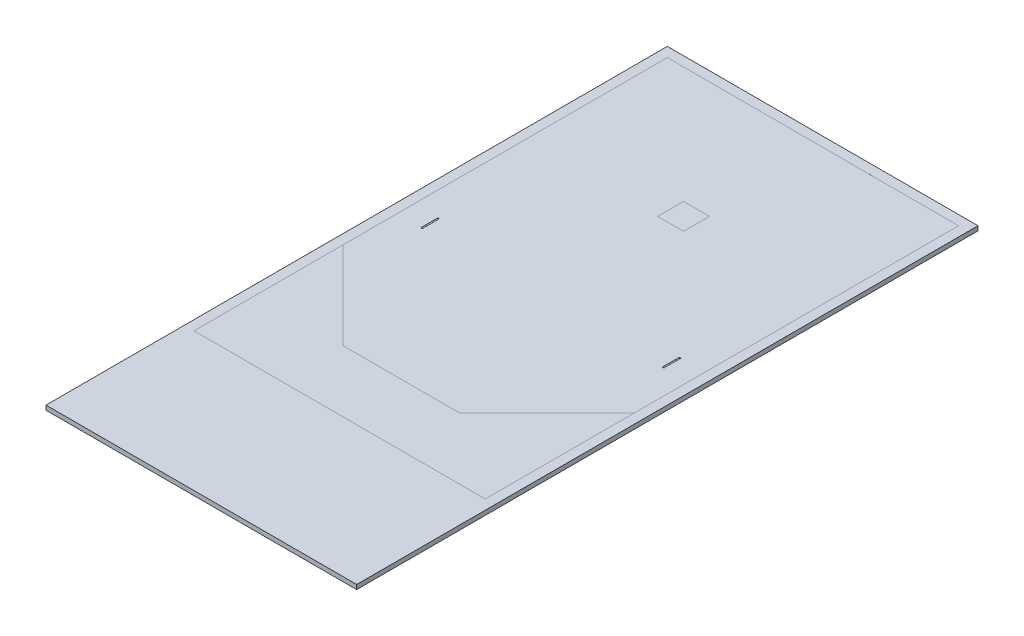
ISO-10303-21;
HEADER;
FILE_DESCRIPTION(('STEP AP214'),'2;1');
FILE_NAME('part.step','',(''),(''),'','','');
FILE_SCHEMA(('AUTOMOTIVE_DESIGN { 1 0 10303 214 1 1 1 1 }'));
ENDSEC;
DATA;
#1=APPLICATION_CONTEXT('core data for automotive mechanical design processes');
#2=APPLICATION_PROTOCOL_DEFINITION('international standard','automotive_design',2000,#1);
#3=PRODUCT_CONTEXT('',#1,'mechanical');
#4=PRODUCT('Part','Part','',(#3));
#5=PRODUCT_RELATED_PRODUCT_CATEGORY('part','',(#4));
#6=PRODUCT_DEFINITION_FORMATION('','',#4);
#7=PRODUCT_DEFINITION_CONTEXT('part definition',#1,'design');
#8=PRODUCT_DEFINITION('design','',#6,#7);
#9=PRODUCT_DEFINITION_SHAPE('','',#8);
#10=(LENGTH_UNIT() NAMED_UNIT(*) SI_UNIT(.MILLI.,.METRE.));
#11=(NAMED_UNIT(*) PLANE_ANGLE_UNIT() SI_UNIT($,.RADIAN.));
#12=(NAMED_UNIT(*) SI_UNIT($,.STERADIAN.) SOLID_ANGLE_UNIT());
#13=UNCERTAINTY_MEASURE_WITH_UNIT(LENGTH_MEASURE(1.E-05),#10,'distance_accuracy_value','');
#14=(GEOMETRIC_REPRESENTATION_CONTEXT(3) GLOBAL_UNCERTAINTY_ASSIGNED_CONTEXT((#13)) GLOBAL_UNIT_ASSIGNED_CONTEXT((#10,
#11,#12)) REPRESENTATION_CONTEXT('',''));
#15=CARTESIAN_POINT('',(0.,0.,0.));
#16=DIRECTION('',(0.,0.,1.));
#17=DIRECTION('',(1.,0.,0.));
#18=AXIS2_PLACEMENT_3D('',#15,#16,#17);
#19=CARTESIAN_POINT('',(0.,8.730742,0.));
#20=DIRECTION('',(0.,1.,0.));
#21=DIRECTION('',(0.,0.,1.));
#22=AXIS2_PLACEMENT_3D('',#19,#20,#21);
#23=PLANE('',#22);
#24=DIRECTION('',(-1.,0.,0.));
#25=VECTOR('',#24,1.);
#26=CARTESIAN_POINT('',(0.,8.730742,-1404.9375));
#27=LINE('',#26,#25);
#28=CARTESIAN_POINT('',(-470.68740004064,8.730742,-1404.9375));
#29=VERTEX_POINT('',#28);
#30=CARTESIAN_POINT('',(-477.03739995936,8.730742,-1404.9375));
#31=VERTEX_POINT('',#30);
#32=EDGE_CURVE('E11',#29,#31,#27,.T.);
#33=ORIENTED_EDGE('',*,*,#32,.F.);
#34=DIRECTION('',(0.,0.,1.));
#35=VECTOR('',#34,1.);
#36=CARTESIAN_POINT('',(-470.68740004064,8.730742,-1404.9375));
#37=LINE('',#36,#35);
#38=CARTESIAN_POINT('',(-470.68740004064,8.730742,-1338.2625));
#39=VERTEX_POINT('',#38);
#40=EDGE_CURVE('E174',#39,#29,#37,.F.);
#41=ORIENTED_EDGE('',*,*,#40,.F.);
#42=DIRECTION('',(-1.,0.,0.));
#43=VECTOR('',#42,1.);
#44=CARTESIAN_POINT('',(0.,8.730742,-1338.2625));
#45=LINE('',#44,#43);
#46=CARTESIAN_POINT('',(-477.0374,8.730742,-1338.2625));
#47=VERTEX_POINT('',#46);
#48=EDGE_CURVE('E169',#39,#47,#45,.T.);
#49=ORIENTED_EDGE('',*,*,#48,.T.);
#50=DIRECTION('',(0.,0.,1.));
#51=VECTOR('',#50,1.);
#52=CARTESIAN_POINT('',(-477.03739995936,8.730742,-1404.9375));
#53=LINE('',#52,#51);
#54=EDGE_CURVE('E43',#31,#47,#53,.T.);
#55=ORIENTED_EDGE('',*,*,#54,.F.);
#56=EDGE_LOOP('',(#33,#41,#49,#55));
#57=FACE_BOUND('',#56,.T.);
#58=DIRECTION('',(-1.,0.,0.));
#59=VECTOR('',#58,1.);
#60=CARTESIAN_POINT('',(0.,8.730742,-1404.9375));
#61=LINE('',#60,#59);
#62=CARTESIAN_POINT('',(477.03739995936,8.730742,-1404.9375));
#63=VERTEX_POINT('',#62);
#64=CARTESIAN_POINT('',(470.68740004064,8.730742,-1404.9375));
#65=VERTEX_POINT('',#64);
#66=EDGE_CURVE('E175',#63,#65,#61,.T.);
#67=ORIENTED_EDGE('',*,*,#66,.F.);
#68=DIRECTION('',(0.,0.,1.));
#69=VECTOR('',#68,1.);
#70=CARTESIAN_POINT('',(477.03739995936,8.730742,-1404.9375));
#71=LINE('',#70,#69);
#72=CARTESIAN_POINT('',(477.03739995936,8.730742,-1338.2625));
#73=VERTEX_POINT('',#72);
#74=EDGE_CURVE('E191',#63,#73,#71,.T.);
#75=ORIENTED_EDGE('',*,*,#74,.T.);
#76=DIRECTION('',(-1.,0.,0.));
#77=VECTOR('',#76,1.);
#78=CARTESIAN_POINT('',(0.,8.730742,-1338.2625));
#79=LINE('',#78,#77);
#80=CARTESIAN_POINT('',(470.6874,8.730742,-1338.2625));
#81=VERTEX_POINT('',#80);
#82=EDGE_CURVE('E194',#73,#81,#79,.T.);
#83=ORIENTED_EDGE('',*,*,#82,.T.);
#84=DIRECTION('',(0.,0.,1.));
#85=VECTOR('',#84,1.);
#86=CARTESIAN_POINT('',(470.68740004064,8.730742,-1404.9375));
#87=LINE('',#86,#85);
#88=EDGE_CURVE('E188',#81,#65,#87,.F.);
#89=ORIENTED_EDGE('',*,*,#88,.T.);
#90=EDGE_LOOP('',(#67,#75,#83,#89));
#91=FACE_BOUND('',#90,.T.);
#92=DIRECTION('',(0.,0.,1.));
#93=VECTOR('',#92,1.);
#94=CARTESIAN_POINT('',(571.5,8.730742,0.));
#95=LINE('',#94,#93);
#96=CARTESIAN_POINT('',(571.5,8.730742,-2400.3));
#97=VERTEX_POINT('',#96);
#98=CARTESIAN_POINT('',(571.5,8.730742,-1127.7854));
#99=VERTEX_POINT('',#98);
#100=EDGE_CURVE('E277',#97,#99,#95,.T.);
#101=ORIENTED_EDGE('',*,*,#100,.F.);
#102=DIRECTION('',(1.,0.,0.));
#103=VECTOR('',#102,1.);
#104=CARTESIAN_POINT('',(0.,8.730742,-2400.3));
#105=LINE('',#104,#103);
#106=CARTESIAN_POINT('',(-571.5,8.730742,-2400.3));
#107=VERTEX_POINT('',#106);
#108=EDGE_CURVE('E289',#107,#97,#105,.T.);
#109=ORIENTED_EDGE('',*,*,#108,.F.);
#110=DIRECTION('',(0.,0.,-1.));
#111=VECTOR('',#110,1.);
#112=CARTESIAN_POINT('',(-571.5,8.730742,0.));
#113=LINE('',#112,#111);
#114=CARTESIAN_POINT('',(-571.5,8.730742,-1127.7854));
#115=VERTEX_POINT('',#114);
#116=EDGE_CURVE('E287',#115,#107,#113,.T.);
#117=ORIENTED_EDGE('',*,*,#116,.F.);
#118=DIRECTION('',(0.707106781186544,0.,0.707106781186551));
#119=VECTOR('',#118,1.);
#120=CARTESIAN_POINT('',(278.142699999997,8.730742,-278.142699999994));
#121=LINE('',#120,#119);
#122=CARTESIAN_POINT('',(-228.6,8.730742,-784.885399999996));
#123=VERTEX_POINT('',#122);
#124=EDGE_CURVE('E284',#115,#123,#121,.T.);
#125=ORIENTED_EDGE('',*,*,#124,.T.);
#126=DIRECTION('',(1.,0.,0.));
#127=VECTOR('',#126,1.);
#128=CARTESIAN_POINT('',(3.81188907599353E-13,8.730742,-784.885399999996));
#129=LINE('',#128,#127);
#130=CARTESIAN_POINT('',(228.6,8.730742,-784.885399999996));
#131=VERTEX_POINT('',#130);
#132=EDGE_CURVE('E281',#123,#131,#129,.T.);
#133=ORIENTED_EDGE('',*,*,#132,.T.);
#134=DIRECTION('',(0.707106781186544,0.,-0.707106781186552));
#135=VECTOR('',#134,1.);
#136=CARTESIAN_POINT('',(-278.142699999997,8.730742,-278.142699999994));
#137=LINE('',#136,#135);
#138=EDGE_CURVE('E261',#131,#99,#137,.T.);
#139=ORIENTED_EDGE('',*,*,#138,.T.);
#140=EDGE_LOOP('',(#101,#109,#117,#125,#133,#139));
#141=FACE_BOUND('',#140,.T.);
#142=DIRECTION('',(0.,0.,1.));
#143=VECTOR('',#142,1.);
#144=CARTESIAN_POINT('',(-50.8000000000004,8.730742,-1841.5));
#145=LINE('',#144,#143);
#146=CARTESIAN_POINT('',(-50.8000000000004,8.730742,-1943.1));
#147=VERTEX_POINT('',#146);
#148=CARTESIAN_POINT('',(-50.8000000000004,8.730742,-1841.5));
#149=VERTEX_POINT('',#148);
#150=EDGE_CURVE('E313',#147,#149,#145,.T.);
#151=ORIENTED_EDGE('',*,*,#150,.F.);
#152=DIRECTION('',(-1.,0.,0.));
#153=VECTOR('',#152,1.);
#154=CARTESIAN_POINT('',(50.7999999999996,8.730742,-1943.1));
#155=LINE('',#154,#153);
#156=CARTESIAN_POINT('',(50.7999999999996,8.730742,-1943.1));
#157=VERTEX_POINT('',#156);
#158=EDGE_CURVE('E305',#157,#147,#155,.T.);
#159=ORIENTED_EDGE('',*,*,#158,.F.);
#160=DIRECTION('',(0.,0.,-1.));
#161=VECTOR('',#160,1.);
#162=CARTESIAN_POINT('',(50.7999999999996,8.730742,-1841.5));
#163=LINE('',#162,#161);
#164=CARTESIAN_POINT('',(50.7999999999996,8.730742,-1841.5));
#165=VERTEX_POINT('',#164);
#166=EDGE_CURVE('E307',#165,#157,#163,.T.);
#167=ORIENTED_EDGE('',*,*,#166,.F.);
#168=DIRECTION('',(1.,0.,0.));
#169=VECTOR('',#168,1.);
#170=CARTESIAN_POINT('',(50.7999999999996,8.730742,-1841.5));
#171=LINE('',#170,#169);
#172=EDGE_CURVE('E310',#149,#165,#171,.T.);
#173=ORIENTED_EDGE('',*,*,#172,.F.);
#174=EDGE_LOOP('',(#151,#159,#167,#173));
#175=FACE_BOUND('',#174,.T.);
#176=ADVANCED_FACE('F35',(#57,#91,#141,#175),#23,.T.);
#177=CARTESIAN_POINT('',(-609.6,8.73125,-2438.4));
#178=DIRECTION('',(0.,-1.,0.));
#179=DIRECTION('',(0.,0.,-1.));
#180=AXIS2_PLACEMENT_3D('',#177,#178,#179);
#181=PLANE('',#180);
#182=DIRECTION('',(1.,0.,0.));
#183=VECTOR('',#182,1.);
#184=CARTESIAN_POINT('',(-609.6,8.73125,0.));
#185=LINE('',#184,#183);
#186=CARTESIAN_POINT('',(-609.6,8.73125,0.));
#187=VERTEX_POINT('',#186);
#188=CARTESIAN_POINT('',(609.6,8.73125,0.));
#189=VERTEX_POINT('',#188);
#190=EDGE_CURVE('E214',#187,#189,#185,.T.);
#191=ORIENTED_EDGE('',*,*,#190,.T.);
#192=DIRECTION('',(0.,0.,1.));
#193=VECTOR('',#192,1.);
#194=CARTESIAN_POINT('',(609.6,8.73125,-2438.4));
#195=LINE('',#194,#193);
#196=CARTESIAN_POINT('',(609.6,8.73125,-2438.4));
#197=VERTEX_POINT('',#196);
#198=EDGE_CURVE('E200',#197,#189,#195,.T.);
#199=ORIENTED_EDGE('',*,*,#198,.F.);
#200=DIRECTION('',(1.,0.,0.));
#201=VECTOR('',#200,1.);
#202=CARTESIAN_POINT('',(-609.6,8.73125,-2438.4));
#203=LINE('',#202,#201);
#204=CARTESIAN_POINT('',(-609.6,8.73125,-2438.4));
#205=VERTEX_POINT('',#204);
#206=EDGE_CURVE('E226',#205,#197,#203,.T.);
#207=ORIENTED_EDGE('',*,*,#206,.F.);
#208=DIRECTION('',(0.,0.,1.));
#209=VECTOR('',#208,1.);
#210=CARTESIAN_POINT('',(-609.6,8.73125,-2438.4));
#211=LINE('',#210,#209);
#212=EDGE_CURVE('E197',#205,#187,#211,.T.);
#213=ORIENTED_EDGE('',*,*,#212,.T.);
#214=EDGE_LOOP('',(#191,#199,#207,#213));
#215=FACE_BOUND('',#214,.T.);
#216=DIRECTION('',(1.,0.,0.));
#217=VECTOR('',#216,1.);
#218=CARTESIAN_POINT('',(0.,8.73125,-2400.3));
#219=LINE('',#218,#217);
#220=CARTESIAN_POINT('',(-571.5,8.73125,-2400.3));
#221=VERTEX_POINT('',#220);
#222=CARTESIAN_POINT('',(571.5,8.73125,-2400.3));
#223=VERTEX_POINT('',#222);
#224=EDGE_CURVE('E274',#221,#223,#219,.T.);
#225=ORIENTED_EDGE('',*,*,#224,.T.);
#226=DIRECTION('',(0.,0.,1.));
#227=VECTOR('',#226,1.);
#228=CARTESIAN_POINT('',(571.5,8.73125,0.));
#229=LINE('',#228,#227);
#230=CARTESIAN_POINT('',(571.5,8.73125,-542.925));
#231=VERTEX_POINT('',#230);
#232=EDGE_CURVE('E235',#223,#231,#229,.T.);
#233=ORIENTED_EDGE('',*,*,#232,.T.);
#234=DIRECTION('',(1.,0.,0.));
#235=VECTOR('',#234,1.);
#236=CARTESIAN_POINT('',(0.,8.73125,-542.925));
#237=LINE('',#236,#235);
#238=CARTESIAN_POINT('',(-571.5,8.73125,-542.925));
#239=VERTEX_POINT('',#238);
#240=EDGE_CURVE('E239',#239,#231,#237,.T.);
#241=ORIENTED_EDGE('',*,*,#240,.F.);
#242=DIRECTION('',(0.,0.,-1.));
#243=VECTOR('',#242,1.);
#244=CARTESIAN_POINT('',(-571.5,8.73125,0.));
#245=LINE('',#244,#243);
#246=EDGE_CURVE('E242',#239,#221,#245,.T.);
#247=ORIENTED_EDGE('',*,*,#246,.T.);
#248=EDGE_LOOP('',(#225,#233,#241,#247));
#249=FACE_BOUND('',#248,.T.);
#250=ADVANCED_FACE('F339',(#215,#249),#181,.F.);
#251=CARTESIAN_POINT('',(-609.6,-8.73125,-2438.4));
#252=DIRECTION('',(1.,0.,0.));
#253=DIRECTION('',(0.,0.,-1.));
#254=AXIS2_PLACEMENT_3D('',#251,#252,#253);
#255=PLANE('',#254);
#256=DIRECTION('',(0.,1.,0.));
#257=VECTOR('',#256,1.);
#258=CARTESIAN_POINT('',(-609.6,-8.73125,0.));
#259=LINE('',#258,#257);
#260=CARTESIAN_POINT('',(-609.6,-8.73125,0.));
#261=VERTEX_POINT('',#260);
#262=EDGE_CURVE('E217',#261,#187,#259,.T.);
#263=ORIENTED_EDGE('',*,*,#262,.T.);
#264=ORIENTED_EDGE('',*,*,#212,.F.);
#265=DIRECTION('',(0.,1.,0.));
#266=VECTOR('',#265,1.);
#267=CARTESIAN_POINT('',(-609.6,-8.73125,-2438.4));
#268=LINE('',#267,#266);
#269=CARTESIAN_POINT('',(-609.6,-8.73125,-2438.4));
#270=VERTEX_POINT('',#269);
#271=EDGE_CURVE('E210',#270,#205,#268,.T.);
#272=ORIENTED_EDGE('',*,*,#271,.F.);
#273=DIRECTION('',(0.,0.,1.));
#274=VECTOR('',#273,1.);
#275=CARTESIAN_POINT('',(-609.6,-8.73125,-2438.4));
#276=LINE('',#275,#274);
#277=EDGE_CURVE('E204',#270,#261,#276,.T.);
#278=ORIENTED_EDGE('',*,*,#277,.T.);
#279=EDGE_LOOP('',(#263,#264,#272,#278));
#280=FACE_BOUND('',#279,.T.);
#281=ADVANCED_FACE('F37',(#280),#255,.F.);
#282=CARTESIAN_POINT('',(609.6,-8.73125,-2438.4));
#283=DIRECTION('',(1.,0.,0.));
#284=DIRECTION('',(0.,0.,-1.));
#285=AXIS2_PLACEMENT_3D('',#282,#283,#284);
#286=PLANE('',#285);
#287=DIRECTION('',(0.,1.,0.));
#288=VECTOR('',#287,1.);
#289=CARTESIAN_POINT('',(609.6,-8.73125,0.));
#290=LINE('',#289,#288);
#291=CARTESIAN_POINT('',(609.6,-8.73125,0.));
#292=VERTEX_POINT('',#291);
#293=EDGE_CURVE('E211',#292,#189,#290,.T.);
#294=ORIENTED_EDGE('',*,*,#293,.F.);
#295=DIRECTION('',(0.,0.,1.));
#296=VECTOR('',#295,1.);
#297=CARTESIAN_POINT('',(609.6,-8.73125,-2438.4));
#298=LINE('',#297,#296);
#299=CARTESIAN_POINT('',(609.6,-8.73125,-2438.4));
#300=VERTEX_POINT('',#299);
#301=EDGE_CURVE('E202',#300,#292,#298,.T.);
#302=ORIENTED_EDGE('',*,*,#301,.F.);
#303=DIRECTION('',(0.,1.,0.));
#304=VECTOR('',#303,1.);
#305=CARTESIAN_POINT('',(609.6,-8.73125,-2438.4));
#306=LINE('',#305,#304);
#307=EDGE_CURVE('E223',#300,#197,#306,.T.);
#308=ORIENTED_EDGE('',*,*,#307,.T.);
#309=ORIENTED_EDGE('',*,*,#198,.T.);
#310=EDGE_LOOP('',(#294,#302,#308,#309));
#311=FACE_BOUND('',#310,.T.);
#312=ADVANCED_FACE('F394',(#311),#286,.T.);
#313=CARTESIAN_POINT('',(-609.6,-8.73125,-2438.4));
#314=DIRECTION('',(0.,-1.,0.));
#315=DIRECTION('',(0.,0.,-1.));
#316=AXIS2_PLACEMENT_3D('',#313,#314,#315);
#317=PLANE('',#316);
#318=DIRECTION('',(1.,0.,0.));
#319=VECTOR('',#318,1.);
#320=CARTESIAN_POINT('',(-609.6,-8.73125,0.));
#321=LINE('',#320,#319);
#322=EDGE_CURVE('E207',#261,#292,#321,.T.);
#323=ORIENTED_EDGE('',*,*,#322,.F.);
#324=ORIENTED_EDGE('',*,*,#277,.F.);
#325=DIRECTION('',(1.,0.,0.));
#326=VECTOR('',#325,1.);
#327=CARTESIAN_POINT('',(-609.6,-8.73125,-2438.4));
#328=LINE('',#327,#326);
#329=EDGE_CURVE('E206',#270,#300,#328,.T.);
#330=ORIENTED_EDGE('',*,*,#329,.T.);
#331=ORIENTED_EDGE('',*,*,#301,.T.);
#332=EDGE_LOOP('',(#323,#324,#330,#331));
#333=FACE_BOUND('',#332,.T.);
#334=ADVANCED_FACE('F387',(#333),#317,.T.);
#335=CARTESIAN_POINT('',(0.,0.,-2438.4));
#336=DIRECTION('',(0.,0.,-1.));
#337=DIRECTION('',(-1.,0.,0.));
#338=AXIS2_PLACEMENT_3D('',#335,#336,#337);
#339=PLANE('',#338);
#340=ORIENTED_EDGE('',*,*,#271,.T.);
#341=ORIENTED_EDGE('',*,*,#206,.T.);
#342=ORIENTED_EDGE('',*,*,#307,.F.);
#343=ORIENTED_EDGE('',*,*,#329,.F.);
#344=EDGE_LOOP('',(#340,#341,#342,#343));
#345=FACE_BOUND('',#344,.T.);
#346=ADVANCED_FACE('F384',(#345),#339,.T.);
#347=CARTESIAN_POINT('',(0.,0.,0.));
#348=DIRECTION('',(0.,0.,-1.));
#349=DIRECTION('',(-1.,0.,0.));
#350=AXIS2_PLACEMENT_3D('',#347,#348,#349);
#351=PLANE('',#350);
#352=ORIENTED_EDGE('',*,*,#262,.F.);
#353=ORIENTED_EDGE('',*,*,#322,.T.);
#354=ORIENTED_EDGE('',*,*,#293,.T.);
#355=ORIENTED_EDGE('',*,*,#190,.F.);
#356=EDGE_LOOP('',(#352,#353,#354,#355));
#357=FACE_BOUND('',#356,.T.);
#358=ADVANCED_FACE('F382',(#357),#351,.F.);
#359=CARTESIAN_POINT('',(-571.5,8.730996,0.));
#360=DIRECTION('',(1.,0.,0.));
#361=DIRECTION('',(0.,0.,-1.));
#362=AXIS2_PLACEMENT_3D('',#359,#360,#361);
#363=PLANE('',#362);
#364=ORIENTED_EDGE('',*,*,#246,.F.);
#365=DIRECTION('',(0.,1.,0.));
#366=VECTOR('',#365,1.);
#367=CARTESIAN_POINT('',(-571.5,8.730996,-542.925));
#368=LINE('',#367,#366);
#369=CARTESIAN_POINT('',(-571.5,8.730996,-542.925));
#370=VERTEX_POINT('',#369);
#371=EDGE_CURVE('E230',#370,#239,#368,.T.);
#372=ORIENTED_EDGE('',*,*,#371,.F.);
#373=DIRECTION('',(0.,0.,-1.));
#374=VECTOR('',#373,1.);
#375=CARTESIAN_POINT('',(-571.5,8.730996,0.));
#376=LINE('',#375,#374);
#377=CARTESIAN_POINT('',(-571.5,8.730996,-1127.7854));
#378=VERTEX_POINT('',#377);
#379=EDGE_CURVE('E238',#370,#378,#376,.T.);
#380=ORIENTED_EDGE('',*,*,#379,.T.);
#381=DIRECTION('',(0.,1.,0.));
#382=VECTOR('',#381,1.);
#383=CARTESIAN_POINT('',(-571.5,8.730742,-1127.7854));
#384=LINE('',#383,#382);
#385=EDGE_CURVE('E264',#115,#378,#384,.T.);
#386=ORIENTED_EDGE('',*,*,#385,.F.);
#387=ORIENTED_EDGE('',*,*,#116,.T.);
#388=DIRECTION('',(0.,1.,0.));
#389=VECTOR('',#388,1.);
#390=CARTESIAN_POINT('',(-571.5,8.730742,-2400.3));
#391=LINE('',#390,#389);
#392=EDGE_CURVE('E260',#107,#221,#391,.T.);
#393=ORIENTED_EDGE('',*,*,#392,.T.);
#394=EDGE_LOOP('',(#364,#372,#380,#386,#387,#393));
#395=FACE_BOUND('',#394,.T.);
#396=ADVANCED_FACE('F375',(#395),#363,.T.);
#397=CARTESIAN_POINT('',(571.5,8.730996,0.));
#398=DIRECTION('',(-1.,0.,0.));
#399=DIRECTION('',(0.,0.,1.));
#400=AXIS2_PLACEMENT_3D('',#397,#398,#399);
#401=PLANE('',#400);
#402=ORIENTED_EDGE('',*,*,#232,.F.);
#403=DIRECTION('',(0.,1.,0.));
#404=VECTOR('',#403,1.);
#405=CARTESIAN_POINT('',(571.5,8.730742,-2400.3));
#406=LINE('',#405,#404);
#407=EDGE_CURVE('E257',#97,#223,#406,.T.);
#408=ORIENTED_EDGE('',*,*,#407,.F.);
#409=ORIENTED_EDGE('',*,*,#100,.T.);
#410=DIRECTION('',(0.,1.,0.));
#411=VECTOR('',#410,1.);
#412=CARTESIAN_POINT('',(571.5,8.730742,-1127.7854));
#413=LINE('',#412,#411);
#414=CARTESIAN_POINT('',(571.5,8.730996,-1127.7854));
#415=VERTEX_POINT('',#414);
#416=EDGE_CURVE('E244',#99,#415,#413,.T.);
#417=ORIENTED_EDGE('',*,*,#416,.T.);
#418=DIRECTION('',(0.,0.,1.));
#419=VECTOR('',#418,1.);
#420=CARTESIAN_POINT('',(571.5,8.730996,0.));
#421=LINE('',#420,#419);
#422=CARTESIAN_POINT('',(571.5,8.730996,-542.925));
#423=VERTEX_POINT('',#422);
#424=EDGE_CURVE('E250',#415,#423,#421,.T.);
#425=ORIENTED_EDGE('',*,*,#424,.T.);
#426=DIRECTION('',(0.,1.,0.));
#427=VECTOR('',#426,1.);
#428=CARTESIAN_POINT('',(571.5,8.730996,-542.925));
#429=LINE('',#428,#427);
#430=EDGE_CURVE('E220',#423,#231,#429,.T.);
#431=ORIENTED_EDGE('',*,*,#430,.T.);
#432=EDGE_LOOP('',(#402,#408,#409,#417,#425,#431));
#433=FACE_BOUND('',#432,.T.);
#434=ADVANCED_FACE('F372',(#433),#401,.T.);
#435=CARTESIAN_POINT('',(0.,8.730996,-542.925));
#436=DIRECTION('',(0.,0.,1.));
#437=DIRECTION('',(1.,0.,0.));
#438=AXIS2_PLACEMENT_3D('',#435,#436,#437);
#439=PLANE('',#438);
#440=ORIENTED_EDGE('',*,*,#240,.T.);
#441=ORIENTED_EDGE('',*,*,#430,.F.);
#442=DIRECTION('',(1.,0.,0.));
#443=VECTOR('',#442,1.);
#444=CARTESIAN_POINT('',(0.,8.730996,-542.925));
#445=LINE('',#444,#443);
#446=EDGE_CURVE('E252',#370,#423,#445,.T.);
#447=ORIENTED_EDGE('',*,*,#446,.F.);
#448=ORIENTED_EDGE('',*,*,#371,.T.);
#449=EDGE_LOOP('',(#440,#441,#447,#448));
#450=FACE_BOUND('',#449,.T.);
#451=ADVANCED_FACE('F370',(#450),#439,.F.);
#452=CARTESIAN_POINT('',(0.,8.730996,0.));
#453=DIRECTION('',(0.,1.,0.));
#454=DIRECTION('',(0.,0.,1.));
#455=AXIS2_PLACEMENT_3D('',#452,#453,#454);
#456=PLANE('',#455);
#457=ORIENTED_EDGE('',*,*,#379,.F.);
#458=ORIENTED_EDGE('',*,*,#446,.T.);
#459=ORIENTED_EDGE('',*,*,#424,.F.);
#460=DIRECTION('',(0.707106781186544,0.,-0.707106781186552));
#461=VECTOR('',#460,1.);
#462=CARTESIAN_POINT('',(-278.142699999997,8.730996,-278.142699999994));
#463=LINE('',#462,#461);
#464=CARTESIAN_POINT('',(228.6,8.730996,-784.885399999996));
#465=VERTEX_POINT('',#464);
#466=EDGE_CURVE('E248',#465,#415,#463,.T.);
#467=ORIENTED_EDGE('',*,*,#466,.F.);
#468=DIRECTION('',(1.,0.,0.));
#469=VECTOR('',#468,1.);
#470=CARTESIAN_POINT('',(3.81188907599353E-13,8.730996,-784.885399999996));
#471=LINE('',#470,#469);
#472=CARTESIAN_POINT('',(-228.6,8.730996,-784.885399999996));
#473=VERTEX_POINT('',#472);
#474=EDGE_CURVE('E246',#473,#465,#471,.T.);
#475=ORIENTED_EDGE('',*,*,#474,.F.);
#476=DIRECTION('',(0.707106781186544,0.,0.707106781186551));
#477=VECTOR('',#476,1.);
#478=CARTESIAN_POINT('',(278.142699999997,8.730996,-278.142699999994));
#479=LINE('',#478,#477);
#480=EDGE_CURVE('E233',#378,#473,#479,.T.);
#481=ORIENTED_EDGE('',*,*,#480,.F.);
#482=EDGE_LOOP('',(#457,#458,#459,#467,#475,#481));
#483=FACE_BOUND('',#482,.T.);
#484=ADVANCED_FACE('F354',(#483),#456,.T.);
#485=CARTESIAN_POINT('',(-278.142699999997,8.730742,-278.142699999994));
#486=DIRECTION('',(0.707106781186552,0.,0.707106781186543));
#487=DIRECTION('',(0.707106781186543,0.,-0.707106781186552));
#488=AXIS2_PLACEMENT_3D('',#485,#486,#487);
#489=PLANE('',#488);
#490=ORIENTED_EDGE('',*,*,#466,.T.);
#491=ORIENTED_EDGE('',*,*,#416,.F.);
#492=ORIENTED_EDGE('',*,*,#138,.F.);
#493=DIRECTION('',(0.,1.,0.));
#494=VECTOR('',#493,1.);
#495=CARTESIAN_POINT('',(228.6,8.730742,-784.885399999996));
#496=LINE('',#495,#494);
#497=EDGE_CURVE('E269',#131,#465,#496,.T.);
#498=ORIENTED_EDGE('',*,*,#497,.T.);
#499=EDGE_LOOP('',(#490,#491,#492,#498));
#500=FACE_BOUND('',#499,.T.);
#501=ADVANCED_FACE('F350',(#500),#489,.F.);
#502=CARTESIAN_POINT('',(3.81188907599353E-13,8.730742,-784.885399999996));
#503=DIRECTION('',(0.,0.,1.));
#504=DIRECTION('',(1.,0.,0.));
#505=AXIS2_PLACEMENT_3D('',#502,#503,#504);
#506=PLANE('',#505);
#507=ORIENTED_EDGE('',*,*,#474,.T.);
#508=ORIENTED_EDGE('',*,*,#497,.F.);
#509=ORIENTED_EDGE('',*,*,#132,.F.);
#510=DIRECTION('',(0.,1.,0.));
#511=VECTOR('',#510,1.);
#512=CARTESIAN_POINT('',(-228.6,8.730742,-784.885399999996));
#513=LINE('',#512,#511);
#514=EDGE_CURVE('E266',#123,#473,#513,.T.);
#515=ORIENTED_EDGE('',*,*,#514,.T.);
#516=EDGE_LOOP('',(#507,#508,#509,#515));
#517=FACE_BOUND('',#516,.T.);
#518=ADVANCED_FACE('F353',(#517),#506,.F.);
#519=CARTESIAN_POINT('',(278.142699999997,8.730742,-278.142699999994));
#520=DIRECTION('',(-0.707106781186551,0.,0.707106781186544));
#521=DIRECTION('',(0.707106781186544,0.,0.707106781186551));
#522=AXIS2_PLACEMENT_3D('',#519,#520,#521);
#523=PLANE('',#522);
#524=ORIENTED_EDGE('',*,*,#480,.T.);
#525=ORIENTED_EDGE('',*,*,#514,.F.);
#526=ORIENTED_EDGE('',*,*,#124,.F.);
#527=ORIENTED_EDGE('',*,*,#385,.T.);
#528=EDGE_LOOP('',(#524,#525,#526,#527));
#529=FACE_BOUND('',#528,.T.);
#530=ADVANCED_FACE('F358',(#529),#523,.F.);
#531=CARTESIAN_POINT('',(0.,8.730742,-2400.3));
#532=DIRECTION('',(0.,0.,1.));
#533=DIRECTION('',(1.,0.,0.));
#534=AXIS2_PLACEMENT_3D('',#531,#532,#533);
#535=PLANE('',#534);
#536=ORIENTED_EDGE('',*,*,#224,.F.);
#537=ORIENTED_EDGE('',*,*,#392,.F.);
#538=ORIENTED_EDGE('',*,*,#108,.T.);
#539=ORIENTED_EDGE('',*,*,#407,.T.);
#540=EDGE_LOOP('',(#536,#537,#538,#539));
#541=FACE_BOUND('',#540,.T.);
#542=ADVANCED_FACE('F362',(#541),#535,.T.);
#543=CARTESIAN_POINT('',(50.7999999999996,152.415347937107,-1943.1));
#544=DIRECTION('',(0.,0.,1.));
#545=DIRECTION('',(1.,0.,0.));
#546=AXIS2_PLACEMENT_3D('',#543,#544,#545);
#547=PLANE('',#546);
#548=DIRECTION('',(0.,-1.,0.));
#549=VECTOR('',#548,1.);
#550=CARTESIAN_POINT('',(-50.8000000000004,152.415347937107,-1943.1));
#551=LINE('',#550,#549);
#552=CARTESIAN_POINT('',(-50.8000000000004,8.73125,-1943.1));
#553=VERTEX_POINT('',#552);
#554=EDGE_CURVE('E302',#553,#147,#551,.T.);
#555=ORIENTED_EDGE('',*,*,#554,.F.);
#556=DIRECTION('',(1.,0.,0.));
#557=VECTOR('',#556,1.);
#558=CARTESIAN_POINT('',(50.7999999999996,8.73125,-1943.1));
#559=LINE('',#558,#557);
#560=CARTESIAN_POINT('',(50.7999999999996,8.73125,-1943.1));
#561=VERTEX_POINT('',#560);
#562=EDGE_CURVE('E292',#553,#561,#559,.T.);
#563=ORIENTED_EDGE('',*,*,#562,.T.);
#564=DIRECTION('',(0.,-1.,0.));
#565=VECTOR('',#564,1.);
#566=CARTESIAN_POINT('',(50.7999999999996,152.415347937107,-1943.1));
#567=LINE('',#566,#565);
#568=EDGE_CURVE('E300',#561,#157,#567,.T.);
#569=ORIENTED_EDGE('',*,*,#568,.T.);
#570=ORIENTED_EDGE('',*,*,#158,.T.);
#571=EDGE_LOOP('',(#555,#563,#569,#570));
#572=FACE_BOUND('',#571,.T.);
#573=ADVANCED_FACE('F366',(#572),#547,.F.);
#574=CARTESIAN_POINT('',(50.7999999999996,152.415347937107,-1841.5));
#575=DIRECTION('',(-1.,0.,0.));
#576=DIRECTION('',(0.,0.,1.));
#577=AXIS2_PLACEMENT_3D('',#574,#575,#576);
#578=PLANE('',#577);
#579=ORIENTED_EDGE('',*,*,#568,.F.);
#580=DIRECTION('',(0.,0.,1.));
#581=VECTOR('',#580,1.);
#582=CARTESIAN_POINT('',(50.7999999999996,8.73125,-1841.5));
#583=LINE('',#582,#581);
#584=CARTESIAN_POINT('',(50.7999999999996,8.73125,-1841.5));
#585=VERTEX_POINT('',#584);
#586=EDGE_CURVE('E295',#561,#585,#583,.T.);
#587=ORIENTED_EDGE('',*,*,#586,.T.);
#588=DIRECTION('',(0.,-1.,0.));
#589=VECTOR('',#588,1.);
#590=CARTESIAN_POINT('',(50.7999999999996,152.415347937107,-1841.5));
#591=LINE('',#590,#589);
#592=EDGE_CURVE('E298',#585,#165,#591,.T.);
#593=ORIENTED_EDGE('',*,*,#592,.T.);
#594=ORIENTED_EDGE('',*,*,#166,.T.);
#595=EDGE_LOOP('',(#579,#587,#593,#594));
#596=FACE_BOUND('',#595,.T.);
#597=ADVANCED_FACE('F441',(#596),#578,.F.);
#598=CARTESIAN_POINT('',(50.7999999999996,152.415347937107,-1841.5));
#599=DIRECTION('',(0.,0.,-1.));
#600=DIRECTION('',(-1.,0.,0.));
#601=AXIS2_PLACEMENT_3D('',#598,#599,#600);
#602=PLANE('',#601);
#603=ORIENTED_EDGE('',*,*,#592,.F.);
#604=DIRECTION('',(-1.,0.,0.));
#605=VECTOR('',#604,1.);
#606=CARTESIAN_POINT('',(50.7999999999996,8.73125,-1841.5));
#607=LINE('',#606,#605);
#608=CARTESIAN_POINT('',(-50.8000000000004,8.73125,-1841.5));
#609=VERTEX_POINT('',#608);
#610=EDGE_CURVE('E319',#585,#609,#607,.T.);
#611=ORIENTED_EDGE('',*,*,#610,.T.);
#612=DIRECTION('',(0.,-1.,0.));
#613=VECTOR('',#612,1.);
#614=CARTESIAN_POINT('',(-50.8000000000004,152.415347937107,-1841.5));
#615=LINE('',#614,#613);
#616=EDGE_CURVE('E296',#609,#149,#615,.T.);
#617=ORIENTED_EDGE('',*,*,#616,.T.);
#618=ORIENTED_EDGE('',*,*,#172,.T.);
#619=EDGE_LOOP('',(#603,#611,#617,#618));
#620=FACE_BOUND('',#619,.T.);
#621=ADVANCED_FACE('F444',(#620),#602,.F.);
#622=CARTESIAN_POINT('',(-50.8000000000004,152.415347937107,-1841.5));
#623=DIRECTION('',(1.,0.,0.));
#624=DIRECTION('',(0.,0.,-1.));
#625=AXIS2_PLACEMENT_3D('',#622,#623,#624);
#626=PLANE('',#625);
#627=ORIENTED_EDGE('',*,*,#616,.F.);
#628=DIRECTION('',(0.,0.,-1.));
#629=VECTOR('',#628,1.);
#630=CARTESIAN_POINT('',(-50.8000000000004,8.73125,-1841.5));
#631=LINE('',#630,#629);
#632=EDGE_CURVE('E278',#609,#553,#631,.T.);
#633=ORIENTED_EDGE('',*,*,#632,.T.);
#634=ORIENTED_EDGE('',*,*,#554,.T.);
#635=ORIENTED_EDGE('',*,*,#150,.T.);
#636=EDGE_LOOP('',(#627,#633,#634,#635));
#637=FACE_BOUND('',#636,.T.);
#638=ADVANCED_FACE('F348',(#637),#626,.F.);
#639=CARTESIAN_POINT('',(-609.6,8.73125,-2438.4));
#640=DIRECTION('',(0.,-1.,0.));
#641=DIRECTION('',(0.,0.,-1.));
#642=AXIS2_PLACEMENT_3D('',#639,#640,#641);
#643=PLANE('',#642);
#644=ORIENTED_EDGE('',*,*,#610,.F.);
#645=ORIENTED_EDGE('',*,*,#586,.F.);
#646=ORIENTED_EDGE('',*,*,#562,.F.);
#647=ORIENTED_EDGE('',*,*,#632,.F.);
#648=EDGE_LOOP('',(#644,#645,#646,#647));
#649=FACE_BOUND('',#648,.T.);
#650=ADVANCED_FACE('F446',(#649),#643,.F.);
#651=CARTESIAN_POINT('',(473.8624,8.73125,-1404.9375));
#652=DIRECTION('',(0.,0.,1.));
#653=DIRECTION('',(1.,0.,0.));
#654=AXIS2_PLACEMENT_3D('',#651,#652,#653);
#655=CYLINDRICAL_SURFACE('',#654,3.17499999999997);
#656=CARTESIAN_POINT('',(473.8624,8.73125,-1338.2625));
#657=DIRECTION('',(0.,0.,-1.));
#658=DIRECTION('',(-1.,0.,0.));
#659=AXIS2_PLACEMENT_3D('',#656,#657,#658);
#660=CIRCLE('',#659,3.17499999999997);
#661=EDGE_CURVE('E56',#73,#81,#660,.T.);
#662=ORIENTED_EDGE('',*,*,#661,.F.);
#663=ORIENTED_EDGE('',*,*,#74,.F.);
#664=CARTESIAN_POINT('',(473.8624,8.73125,-1404.9375));
#665=DIRECTION('',(0.,0.,-1.));
#666=DIRECTION('',(-1.,0.,0.));
#667=AXIS2_PLACEMENT_3D('',#664,#665,#666);
#668=CIRCLE('',#667,3.17499999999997);
#669=EDGE_CURVE('E316',#63,#65,#668,.T.);
#670=ORIENTED_EDGE('',*,*,#669,.T.);
#671=ORIENTED_EDGE('',*,*,#88,.F.);
#672=EDGE_LOOP('',(#662,#663,#670,#671));
#673=FACE_BOUND('',#672,.T.);
#674=ADVANCED_FACE('F448',(#673),#655,.F.);
#675=CARTESIAN_POINT('',(0.,0.,-1404.9375));
#676=DIRECTION('',(0.,0.,-1.));
#677=DIRECTION('',(-1.,0.,0.));
#678=AXIS2_PLACEMENT_3D('',#675,#676,#677);
#679=PLANE('',#678);
#680=ORIENTED_EDGE('',*,*,#66,.T.);
#681=ORIENTED_EDGE('',*,*,#669,.F.);
#682=EDGE_LOOP('',(#680,#681));
#683=FACE_BOUND('',#682,.T.);
#684=ADVANCED_FACE('F454',(#683),#679,.F.);
#685=CARTESIAN_POINT('',(0.,0.,-1338.2625));
#686=DIRECTION('',(0.,0.,-1.));
#687=DIRECTION('',(-1.,0.,0.));
#688=AXIS2_PLACEMENT_3D('',#685,#686,#687);
#689=PLANE('',#688);
#690=ORIENTED_EDGE('',*,*,#661,.T.);
#691=ORIENTED_EDGE('',*,*,#82,.F.);
#692=EDGE_LOOP('',(#690,#691));
#693=FACE_BOUND('',#692,.T.);
#694=ADVANCED_FACE('F336',(#693),#689,.T.);
#695=CARTESIAN_POINT('',(-473.8624,8.73125,-1404.9375));
#696=DIRECTION('',(0.,0.,1.));
#697=DIRECTION('',(1.,0.,0.));
#698=AXIS2_PLACEMENT_3D('',#695,#696,#697);
#699=CYLINDRICAL_SURFACE('',#698,3.17499999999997);
#700=ORIENTED_EDGE('',*,*,#54,.T.);
#701=CARTESIAN_POINT('',(-473.8624,8.73125,-1338.2625));
#702=DIRECTION('',(0.,0.,1.));
#703=DIRECTION('',(1.,0.,0.));
#704=AXIS2_PLACEMENT_3D('',#701,#702,#703);
#705=CIRCLE('',#704,3.17499999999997);
#706=EDGE_CURVE('E49',#47,#39,#705,.T.);
#707=ORIENTED_EDGE('',*,*,#706,.T.);
#708=ORIENTED_EDGE('',*,*,#40,.T.);
#709=CARTESIAN_POINT('',(-473.8624,8.73125,-1404.9375));
#710=DIRECTION('',(0.,0.,1.));
#711=DIRECTION('',(1.,0.,0.));
#712=AXIS2_PLACEMENT_3D('',#709,#710,#711);
#713=CIRCLE('',#712,3.17499999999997);
#714=EDGE_CURVE('E181',#31,#29,#713,.T.);
#715=ORIENTED_EDGE('',*,*,#714,.F.);
#716=EDGE_LOOP('',(#700,#707,#708,#715));
#717=FACE_BOUND('',#716,.T.);
#718=ADVANCED_FACE('F178',(#717),#699,.F.);
#719=CARTESIAN_POINT('',(0.,0.,-1404.9375));
#720=DIRECTION('',(0.,0.,-1.));
#721=DIRECTION('',(1.,0.,0.));
#722=AXIS2_PLACEMENT_3D('',#719,#720,#721);
#723=PLANE('',#722);
#724=ORIENTED_EDGE('',*,*,#32,.T.);
#725=ORIENTED_EDGE('',*,*,#714,.T.);
#726=EDGE_LOOP('',(#724,#725));
#727=FACE_BOUND('',#726,.T.);
#728=ADVANCED_FACE('F328',(#727),#723,.F.);
#729=CARTESIAN_POINT('',(0.,0.,-1338.2625));
#730=DIRECTION('',(0.,0.,-1.));
#731=DIRECTION('',(1.,0.,0.));
#732=AXIS2_PLACEMENT_3D('',#729,#730,#731);
#733=PLANE('',#732);
#734=ORIENTED_EDGE('',*,*,#706,.F.);
#735=ORIENTED_EDGE('',*,*,#48,.F.);
#736=EDGE_LOOP('',(#734,#735));
#737=FACE_BOUND('',#736,.T.);
#738=ADVANCED_FACE('F170',(#737),#733,.T.);
#739=CLOSED_SHELL('',(#176,#250,#281,#312,#334,#346,#358,#396,#434,#451,#484,#501,#518,#530,
#542,#573,#597,#621,#638,#650,#674,#684,#694,#718,#728,#738));
#740=MANIFOLD_SOLID_BREP('B2',#739);
#741=ADVANCED_BREP_SHAPE_REPRESENTATION('',(#18,#740),#14);
#742=SHAPE_DEFINITION_REPRESENTATION(#9,#741);
ENDSEC;
END-ISO-10303-21;
